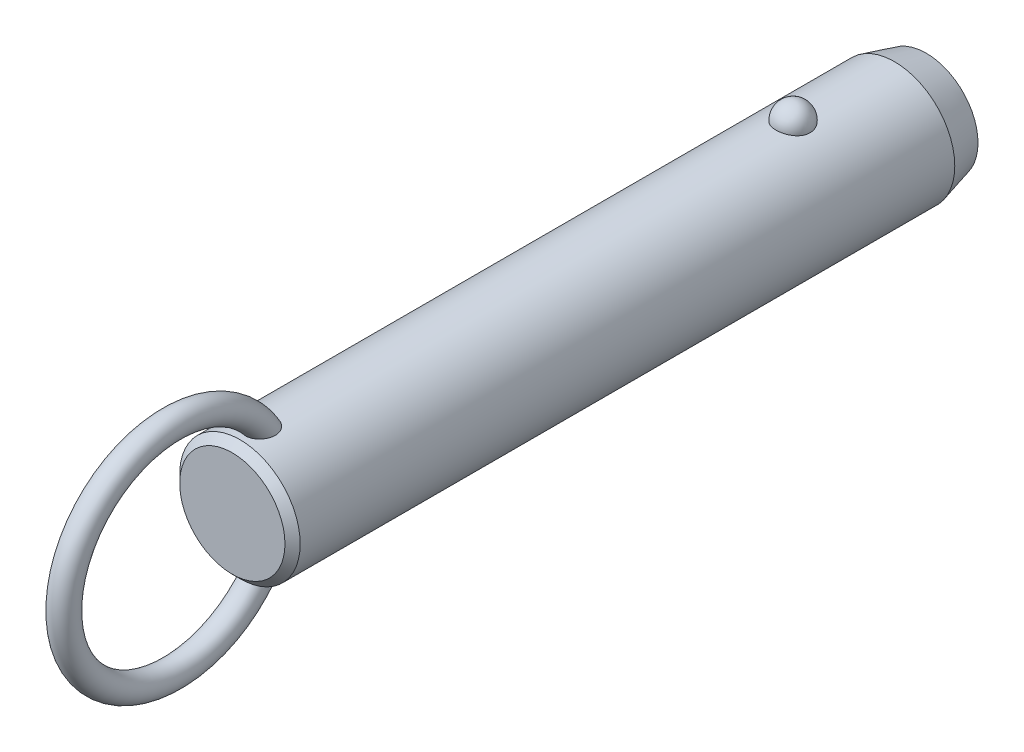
ISO-10303-21;
HEADER;
FILE_DESCRIPTION(('STEP AP214'),'2;1');
FILE_NAME('part.step','',(''),(''),'','','');
FILE_SCHEMA(('AUTOMOTIVE_DESIGN { 1 0 10303 214 1 1 1 1 }'));
ENDSEC;
DATA;
#1=APPLICATION_CONTEXT('core data for automotive mechanical design processes');
#2=APPLICATION_PROTOCOL_DEFINITION('international standard','automotive_design',2000,#1);
#3=PRODUCT_CONTEXT('',#1,'mechanical');
#4=PRODUCT('Part','Part','',(#3));
#5=PRODUCT_RELATED_PRODUCT_CATEGORY('part','',(#4));
#6=PRODUCT_DEFINITION_FORMATION('','',#4);
#7=PRODUCT_DEFINITION_CONTEXT('part definition',#1,'design');
#8=PRODUCT_DEFINITION('design','',#6,#7);
#9=PRODUCT_DEFINITION_SHAPE('','',#8);
#10=(LENGTH_UNIT() NAMED_UNIT(*) SI_UNIT(.MILLI.,.METRE.));
#11=(NAMED_UNIT(*) PLANE_ANGLE_UNIT() SI_UNIT($,.RADIAN.));
#12=(NAMED_UNIT(*) SI_UNIT($,.STERADIAN.) SOLID_ANGLE_UNIT());
#13=UNCERTAINTY_MEASURE_WITH_UNIT(LENGTH_MEASURE(1.E-05),#10,'distance_accuracy_value','');
#14=(GEOMETRIC_REPRESENTATION_CONTEXT(3) GLOBAL_UNCERTAINTY_ASSIGNED_CONTEXT((#13)) GLOBAL_UNIT_ASSIGNED_CONTEXT((#10,
#11,#12)) REPRESENTATION_CONTEXT('',''));
#15=CARTESIAN_POINT('',(0.,0.,0.));
#16=DIRECTION('',(0.,0.,1.));
#17=DIRECTION('',(1.,0.,0.));
#18=AXIS2_PLACEMENT_3D('',#15,#16,#17);
#19=CARTESIAN_POINT('',(0.,0.,76.2));
#20=DIRECTION('',(0.,0.,-1.));
#21=DIRECTION('',(-1.,0.,0.));
#22=AXIS2_PLACEMENT_3D('',#19,#20,#21);
#23=CYLINDRICAL_SURFACE('',#22,9.5);
#24=CARTESIAN_POINT('',(2.67259918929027,9.11631578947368,-2.70000000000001));
#25=CARTESIAN_POINT('',(2.6725968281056,9.11631786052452,-2.54909854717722));
#26=CARTESIAN_POINT('',(2.66030567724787,9.11994722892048,-2.39816735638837));
#27=CARTESIAN_POINT('',(2.6114347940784,9.13405924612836,-2.10058568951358));
#28=CARTESIAN_POINT('',(2.57484658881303,9.14454428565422,-1.95393672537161));
#29=CARTESIAN_POINT('',(2.47830875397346,9.17117631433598,-1.66916069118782));
#30=CARTESIAN_POINT('',(2.41836936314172,9.18732082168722,-1.53102991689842));
#31=CARTESIAN_POINT('',(2.27661331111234,9.22346780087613,-1.26705393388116));
#32=CARTESIAN_POINT('',(2.19479699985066,9.24347021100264,-1.14120852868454));
#33=CARTESIAN_POINT('',(2.01085282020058,9.28522401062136,-0.904632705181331));
#34=CARTESIAN_POINT('',(1.90862396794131,9.30698376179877,-0.793982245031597));
#35=CARTESIAN_POINT('',(1.6867437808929,9.34973971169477,-0.591607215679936));
#36=CARTESIAN_POINT('',(1.56709244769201,9.37073591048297,-0.499882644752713));
#37=CARTESIAN_POINT('',(1.31393976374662,9.40956370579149,-0.338167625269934));
#38=CARTESIAN_POINT('',(1.18048026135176,9.42740444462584,-0.268113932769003));
#39=CARTESIAN_POINT('',(0.903154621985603,9.45799906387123,-0.151390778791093));
#40=CARTESIAN_POINT('',(0.759289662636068,9.47075351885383,-0.10471867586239));
#41=CARTESIAN_POINT('',(0.46807402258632,9.48956256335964,-0.0367633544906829));
#42=CARTESIAN_POINT('',(0.320836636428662,9.49573643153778,-0.0150275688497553));
#43=CARTESIAN_POINT('',(0.02467145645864,9.50112183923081,0.00396199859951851));
#44=CARTESIAN_POINT('',(-0.124256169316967,9.50033406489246,0.00121819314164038));
#45=CARTESIAN_POINT('',(-0.417264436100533,9.4919475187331,-0.0284441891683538));
#46=CARTESIAN_POINT('',(-0.561384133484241,9.48444885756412,-0.055007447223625));
#47=CARTESIAN_POINT('',(-0.842986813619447,9.46357853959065,-0.131064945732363));
#48=CARTESIAN_POINT('',(-0.98046968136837,9.450206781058,-0.180559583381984));
#49=CARTESIAN_POINT('',(-1.24585005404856,9.41890822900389,-0.301476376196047));
#50=CARTESIAN_POINT('',(-1.37368611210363,9.40095498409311,-0.373026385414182));
#51=CARTESIAN_POINT('',(-1.61552738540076,9.36242964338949,-0.536025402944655));
#52=CARTESIAN_POINT('',(-1.72953116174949,9.34185727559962,-0.627476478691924));
#53=CARTESIAN_POINT('',(-1.9429225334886,9.29984568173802,-0.829844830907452));
#54=CARTESIAN_POINT('',(-2.04198021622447,9.27839736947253,-0.94110821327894));
#55=CARTESIAN_POINT('',(-2.2202646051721,9.23735994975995,-1.17883414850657));
#56=CARTESIAN_POINT('',(-2.29948985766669,9.21777097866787,-1.30529781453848));
#57=CARTESIAN_POINT('',(-2.43697287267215,9.18238994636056,-1.57158566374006));
#58=CARTESIAN_POINT('',(-2.49497068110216,9.16664569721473,-1.71155057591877));
#59=CARTESIAN_POINT('',(-2.5872073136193,9.14104303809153,-1.99961197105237));
#60=CARTESIAN_POINT('',(-2.62144683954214,9.13118445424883,-2.14770821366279));
#61=CARTESIAN_POINT('',(-2.66521466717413,9.11850622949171,-2.44715424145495));
#62=CARTESIAN_POINT('',(-2.67484831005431,9.11565658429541,-2.59848735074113));
#63=CARTESIAN_POINT('',(-2.66946735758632,9.11723375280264,-2.90067317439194));
#64=CARTESIAN_POINT('',(-2.65445345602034,9.12166036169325,-3.05152590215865));
#65=CARTESIAN_POINT('',(-2.60029711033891,9.13724422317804,-3.34766110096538));
#66=CARTESIAN_POINT('',(-2.56127978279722,9.14836656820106,-3.49296833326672));
#67=CARTESIAN_POINT('',(-2.46018844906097,9.17606676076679,-3.77477535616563));
#68=CARTESIAN_POINT('',(-2.39811349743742,9.1926448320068,-3.9112747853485));
#69=CARTESIAN_POINT('',(-2.25202303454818,9.22952198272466,-4.17244273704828));
#70=CARTESIAN_POINT('',(-2.16788714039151,9.24984129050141,-4.29704106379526));
#71=CARTESIAN_POINT('',(-1.9799408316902,9.29188255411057,-4.53013066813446));
#72=CARTESIAN_POINT('',(-1.87612963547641,9.31360456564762,-4.63862130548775));
#73=CARTESIAN_POINT('',(-1.65105429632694,9.35612959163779,-4.8369029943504));
#74=CARTESIAN_POINT('',(-1.52972405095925,9.37692871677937,-4.92661991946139));
#75=CARTESIAN_POINT('',(-1.27318250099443,9.41518970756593,-5.08429106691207));
#76=CARTESIAN_POINT('',(-1.13797219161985,9.432651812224,-5.15224684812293));
#77=CARTESIAN_POINT('',(-0.859280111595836,9.46208255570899,-5.26371827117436));
#78=CARTESIAN_POINT('',(-0.715925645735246,9.47411833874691,-5.30753421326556));
#79=CARTESIAN_POINT('',(-0.423550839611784,9.4916822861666,-5.37076321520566));
#80=CARTESIAN_POINT('',(-0.274531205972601,9.49721125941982,-5.39017930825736));
#81=CARTESIAN_POINT('',(0.021844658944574,9.50110860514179,-5.40390587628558));
#82=CARTESIAN_POINT('',(0.169177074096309,9.49961381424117,-5.39869609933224));
#83=CARTESIAN_POINT('',(0.460808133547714,9.48993906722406,-5.36441955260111));
#84=CARTESIAN_POINT('',(0.605106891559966,9.48175936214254,-5.33535367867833));
#85=CARTESIAN_POINT('',(0.886027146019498,9.4596376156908,-5.25435587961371));
#86=CARTESIAN_POINT('',(1.02267710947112,9.44571881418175,-5.20251612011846));
#87=CARTESIAN_POINT('',(1.28523827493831,9.41358993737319,-5.07741549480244));
#88=CARTESIAN_POINT('',(1.41114877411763,9.39537958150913,-5.00415322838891));
#89=CARTESIAN_POINT('',(1.65085227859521,9.3562644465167,-4.83684599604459));
#90=CARTESIAN_POINT('',(1.76442346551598,9.33532178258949,-4.74249218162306));
#91=CARTESIAN_POINT('',(1.97425672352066,9.29321198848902,-4.53620389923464));
#92=CARTESIAN_POINT('',(2.07051582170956,9.27204482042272,-4.42426641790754));
#93=CARTESIAN_POINT('',(2.24490086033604,9.23139221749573,-4.18363183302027));
#94=CARTESIAN_POINT('',(2.32267019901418,9.21194380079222,-4.05466990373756));
#95=CARTESIAN_POINT('',(2.45584092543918,9.1773419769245,-3.78517836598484));
#96=CARTESIAN_POINT('',(2.5112497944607,9.16218713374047,-3.64465264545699));
#97=CARTESIAN_POINT('',(2.59380876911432,9.13913522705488,-3.37104301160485));
#98=CARTESIAN_POINT('',(2.62330266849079,9.13064624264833,-3.23871053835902));
#99=CARTESIAN_POINT('',(2.66269870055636,9.11923566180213,-2.97092664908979));
#100=CARTESIAN_POINT('',(2.67260130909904,9.11631393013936,-2.83547530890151));
#101=CARTESIAN_POINT('',(2.67259918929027,9.11631578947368,-2.70000000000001));
#102=B_SPLINE_CURVE_WITH_KNOTS('',3,(#24,#25,#26,#27,#28,#29,#30,#31,#32,#33,#34,#35,#36,#37,
#38,#39,#40,#41,#42,#43,#44,#45,#46,#47,#48,#49,#50,#51,#52,#53,#54,#55,#56,#57,#58,#59,#60,#61,
#62,#63,#64,#65,#66,#67,#68,#69,#70,#71,#72,#73,#74,#75,#76,#77,#78,#79,#80,#81,#82,#83,#84,#85,
#86,#87,#88,#89,#90,#91,#92,#93,#94,#95,#96,#97,#98,#99,#100,#101),.UNSPECIFIED.,.T.,.F.,(4,2,2,
2,2,2,2,2,2,2,2,2,2,2,2,2,2,2,2,2,2,2,2,2,2,2,2,2,2,2,2,2,2,2,2,2,2,2,4),(0.,0.452217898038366,
0.904593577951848,1.35677112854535,1.80894144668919,2.26340676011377,2.71787203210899,
3.17099820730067,3.62407318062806,4.06878835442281,4.51345969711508,4.95160616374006,
5.38976021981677,5.83050358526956,6.27129275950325,6.72071308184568,7.17016633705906,
7.6249527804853,8.07972578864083,8.53254856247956,8.98535859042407,9.43582813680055,
9.88631615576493,10.3393155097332,10.7923328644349,11.2471065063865,11.7018475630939,
12.150795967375,12.599688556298,13.0398725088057,13.4800399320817,13.9184421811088,
14.3568730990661,14.802202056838,15.2476074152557,15.7010097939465,16.1542603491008,
16.5602594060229,16.966248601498),.UNSPECIFIED.);
#103=CARTESIAN_POINT('',(2.67259918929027,9.11631578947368,-2.70000000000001));
#104=VERTEX_POINT('',#103);
#105=EDGE_CURVE('E41',#104,#104,#102,.T.);
#106=ORIENTED_EDGE('',*,*,#105,.T.);
#107=EDGE_LOOP('',(#106));
#108=FACE_BOUND('',#107,.T.);
#109=CARTESIAN_POINT('',(0.,0.,84.5200000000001));
#110=DIRECTION('',(0.,0.,1.));
#111=DIRECTION('',(1.,0.,0.));
#112=AXIS2_PLACEMENT_3D('',#109,#110,#111);
#113=CIRCLE('',#112,9.5);
#114=CARTESIAN_POINT('',(9.5,0.,84.5200000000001));
#115=VERTEX_POINT('',#114);
#116=EDGE_CURVE('E10',#115,#115,#113,.F.);
#117=ORIENTED_EDGE('',*,*,#116,.T.);
#118=EDGE_LOOP('',(#117));
#119=FACE_BOUND('',#118,.T.);
#120=CARTESIAN_POINT('',(-0.697062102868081,-9.47439269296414,78.8678088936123));
#121=CARTESIAN_POINT('',(-0.799579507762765,-9.46685146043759,78.9074823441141));
#122=CARTESIAN_POINT('',(-0.898575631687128,-9.45788043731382,78.9559309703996));
#123=CARTESIAN_POINT('',(-1.08670047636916,-9.43811593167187,79.0688685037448));
#124=CARTESIAN_POINT('',(-1.17583204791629,-9.42732297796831,79.133352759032));
#125=CARTESIAN_POINT('',(-1.34179806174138,-9.40513672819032,79.2762099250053));
#126=CARTESIAN_POINT('',(-1.41865133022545,-9.39374438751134,79.354561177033));
#127=CARTESIAN_POINT('',(-1.5586004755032,-9.37154196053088,79.5227524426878));
#128=CARTESIAN_POINT('',(-1.62169476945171,-9.3607319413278,79.6125937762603));
#129=CARTESIAN_POINT('',(-1.73527695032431,-9.34035749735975,79.8045001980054));
#130=CARTESIAN_POINT('',(-1.7852226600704,-9.33085270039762,79.9068910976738));
#131=CARTESIAN_POINT('',(-1.86924997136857,-9.3143834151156,80.118148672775));
#132=CARTESIAN_POINT('',(-1.90332570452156,-9.30741986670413,80.2270177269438));
#133=CARTESIAN_POINT('',(-1.95893603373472,-9.29588482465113,80.4604730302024));
#134=CARTESIAN_POINT('',(-1.97872420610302,-9.29165182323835,80.5854890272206));
#135=CARTESIAN_POINT('',(-2.00062129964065,-9.28695978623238,80.8370805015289));
#136=CARTESIAN_POINT('',(-2.00272284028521,-9.28650232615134,80.963656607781));
#137=CARTESIAN_POINT('',(-1.98958876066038,-9.28932750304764,81.2368157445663));
#138=CARTESIAN_POINT('',(-1.97143366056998,-9.2932400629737,81.3832519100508));
#139=CARTESIAN_POINT('',(-1.91479925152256,-9.30507151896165,81.6720629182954));
#140=CARTESIAN_POINT('',(-1.87629122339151,-9.31299607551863,81.814431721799));
#141=CARTESIAN_POINT('',(-1.77225683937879,-9.33340232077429,82.1151725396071));
#142=CARTESIAN_POINT('',(-1.70334898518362,-9.34641636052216,82.2723691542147));
#143=CARTESIAN_POINT('',(-1.58111062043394,-9.36759153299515,82.4975171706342));
#144=CARTESIAN_POINT('',(-1.53721459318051,-9.37492619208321,82.5707968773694));
#145=CARTESIAN_POINT('',(-1.44302631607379,-9.38988566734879,82.7130740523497));
#146=CARTESIAN_POINT('',(-1.39273721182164,-9.39751033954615,82.7820736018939));
#147=CARTESIAN_POINT('',(-1.26775962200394,-9.41530678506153,82.9369832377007));
#148=CARTESIAN_POINT('',(-1.19052326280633,-9.42548108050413,83.0208712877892));
#149=CARTESIAN_POINT('',(-1.02420241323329,-9.44499825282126,83.1760086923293));
#150=CARTESIAN_POINT('',(-0.935139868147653,-9.45434261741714,83.2472808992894));
#151=CARTESIAN_POINT('',(-0.766610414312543,-9.46930670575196,83.3586955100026));
#152=CARTESIAN_POINT('',(-0.689439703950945,-9.47529223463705,83.4022354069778));
#153=CARTESIAN_POINT('',(-0.528942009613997,-9.48560294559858,83.4763133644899));
#154=CARTESIAN_POINT('',(-0.445620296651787,-9.48992953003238,83.5068624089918));
#155=CARTESIAN_POINT('',(-0.273901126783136,-9.49644161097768,83.5525792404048));
#156=CARTESIAN_POINT('',(-0.185465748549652,-9.49860811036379,83.56761059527));
#157=CARTESIAN_POINT('',(-0.00734541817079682,-9.5004135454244,83.5801494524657));
#158=CARTESIAN_POINT('',(0.0823387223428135,-9.50005405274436,83.5776678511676));
#159=CARTESIAN_POINT('',(0.247679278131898,-9.49708301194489,83.5569959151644));
#160=CARTESIAN_POINT('',(0.323620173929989,-9.49477609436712,83.5409300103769));
#161=CARTESIAN_POINT('',(0.471981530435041,-9.48855917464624,83.4971726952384));
#162=CARTESIAN_POINT('',(0.544400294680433,-9.48464840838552,83.469475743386));
#163=CARTESIAN_POINT('',(0.708947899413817,-9.47398336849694,83.3928026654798));
#164=CARTESIAN_POINT('',(0.799149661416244,-9.46671310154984,83.3397745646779));
#165=CARTESIAN_POINT('',(0.969783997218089,-9.45076225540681,83.2199731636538));
#166=CARTESIAN_POINT('',(1.05019415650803,-9.44207854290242,83.1531692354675));
#167=CARTESIAN_POINT('',(1.23092343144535,-9.42051459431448,82.9807596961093));
#168=CARTESIAN_POINT('',(1.3265249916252,-9.40733378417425,82.8702619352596));
#169=CARTESIAN_POINT('',(1.4989312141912,-9.38140745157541,82.6355614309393));
#170=CARTESIAN_POINT('',(1.57571616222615,-9.36866239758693,82.5113445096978));
#171=CARTESIAN_POINT('',(1.71285426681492,-9.34457644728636,82.2493891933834));
#172=CARTESIAN_POINT('',(1.77266365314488,-9.33328726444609,82.1113623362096));
#173=CARTESIAN_POINT('',(1.87239208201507,-9.31379209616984,81.8280515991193));
#174=CARTESIAN_POINT('',(1.9123015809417,-9.3055875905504,81.682764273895));
#175=CARTESIAN_POINT('',(1.9760418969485,-9.29228394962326,81.3620281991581));
#176=CARTESIAN_POINT('',(1.99587438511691,-9.28797202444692,81.1857248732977));
#177=CARTESIAN_POINT('',(2.0029570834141,-9.28645519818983,80.8324146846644));
#178=CARTESIAN_POINT('',(1.99025930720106,-9.28923895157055,80.6554093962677));
#179=CARTESIAN_POINT('',(1.93735479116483,-9.30038134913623,80.3563381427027));
#180=CARTESIAN_POINT('',(1.90576827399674,-9.30697680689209,80.2326679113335));
#181=CARTESIAN_POINT('',(1.82287484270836,-9.32356855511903,79.992329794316));
#182=CARTESIAN_POINT('',(1.77158213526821,-9.33356239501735,79.8756569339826));
#183=CARTESIAN_POINT('',(1.64885744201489,-9.35602275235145,79.6527061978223));
#184=CARTESIAN_POINT('',(1.57730995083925,-9.36850332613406,79.5464927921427));
#185=CARTESIAN_POINT('',(1.41543264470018,-9.39431873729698,79.3495530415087));
#186=CARTESIAN_POINT('',(1.32510883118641,-9.40765330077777,79.2588217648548));
#187=CARTESIAN_POINT('',(1.13846223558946,-9.43195720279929,79.1050334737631));
#188=CARTESIAN_POINT('',(1.04369890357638,-9.44302894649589,79.0400947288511));
#189=CARTESIAN_POINT('',(0.843965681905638,-9.46296805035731,78.9280388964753));
#190=CARTESIAN_POINT('',(0.73900000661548,-9.4718363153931,78.8809144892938));
#191=CARTESIAN_POINT('',(0.52817529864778,-9.48586140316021,78.8081173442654));
#192=CARTESIAN_POINT('',(0.422686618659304,-9.49119633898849,78.7814024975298));
#193=CARTESIAN_POINT('',(0.208590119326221,-9.49831365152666,78.7460137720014));
#194=CARTESIAN_POINT('',(0.0999817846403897,-9.500095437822,78.7373428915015));
#195=CARTESIAN_POINT('',(-0.126104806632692,-9.49988861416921,78.7383501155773));
#196=CARTESIAN_POINT('',(-0.243578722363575,-9.49757821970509,78.7495942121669));
#197=CARTESIAN_POINT('',(-0.474390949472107,-9.48885165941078,78.793167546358));
#198=CARTESIAN_POINT('',(-0.587729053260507,-9.48243528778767,78.8254978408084));
#199=CARTESIAN_POINT('',(-0.697062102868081,-9.47439269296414,78.8678088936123));
#200=B_SPLINE_CURVE_WITH_KNOTS('',3,(#120,#121,#122,#123,#124,#125,#126,#127,#128,#129,#130,
#131,#132,#133,#134,#135,#136,#137,#138,#139,#140,#141,#142,#143,#144,#145,#146,#147,#148,#149,
#150,#151,#152,#153,#154,#155,#156,#157,#158,#159,#160,#161,#162,#163,#164,#165,#166,#167,#168,
#169,#170,#171,#172,#173,#174,#175,#176,#177,#178,#179,#180,#181,#182,#183,#184,#185,#186,#187,
#188,#189,#190,#191,#192,#193,#194,#195,#196,#197,#198,#199),.UNSPECIFIED.,.T.,.F.,(4,2,2,2,2,2,
2,2,2,2,2,2,2,2,2,2,2,2,2,2,2,2,2,2,2,2,2,2,2,2,2,2,2,2,2,2,2,2,2,4),(0.,0.330119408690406,
0.660143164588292,0.989655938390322,1.31920659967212,1.66074728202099,2.00241415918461,
2.38088696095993,2.75951768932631,3.20065679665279,3.6424200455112,4.15620996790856,
4.41314162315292,4.66994734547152,5.01228664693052,5.35399933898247,5.61943037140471,
5.88463652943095,6.15215502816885,6.41950709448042,6.65144391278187,6.88349136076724,
7.19641200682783,7.51003602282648,7.94779711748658,8.38601491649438,8.83699707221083,
9.28819530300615,9.81778662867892,10.3465317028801,10.7284172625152,11.110028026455,
11.4938603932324,11.8775702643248,12.2220189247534,12.5663259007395,12.8915939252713,
13.2169159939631,13.5689650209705,13.9210316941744),.UNSPECIFIED.);
#201=CARTESIAN_POINT('',(-0.697062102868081,-9.47439269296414,78.8678088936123));
#202=VERTEX_POINT('',#201);
#203=EDGE_CURVE('E59',#202,#202,#200,.T.);
#204=ORIENTED_EDGE('',*,*,#203,.T.);
#205=EDGE_LOOP('',(#204));
#206=FACE_BOUND('',#205,.T.);
#207=CARTESIAN_POINT('',(-0.697062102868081,9.47439269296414,78.8678088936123));
#208=CARTESIAN_POINT('',(-0.597792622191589,9.48169483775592,78.8293956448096));
#209=CARTESIAN_POINT('',(-0.495106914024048,9.48766580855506,78.7991682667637));
#210=CARTESIAN_POINT('',(-0.285876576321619,9.49627648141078,78.7560327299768));
#211=CARTESIAN_POINT('',(-0.179324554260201,9.49890941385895,78.7431597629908));
#212=CARTESIAN_POINT('',(0.0344157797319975,9.50053798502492,78.7351666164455));
#213=CARTESIAN_POINT('',(0.141603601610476,9.49953613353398,78.7400341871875));
#214=CARTESIAN_POINT('',(0.353563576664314,9.49401038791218,78.7673654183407));
#215=CARTESIAN_POINT('',(0.458336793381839,9.48948807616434,78.78982117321));
#216=CARTESIAN_POINT('',(0.66249373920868,9.4774236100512,78.8516719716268));
#217=CARTESIAN_POINT('',(0.761881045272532,9.46988348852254,78.8910556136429));
#218=CARTESIAN_POINT('',(0.952608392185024,9.45260382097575,78.9856342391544));
#219=CARTESIAN_POINT('',(1.04394806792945,9.44286417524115,79.0408299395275));
#220=CARTESIAN_POINT('',(1.21712767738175,9.4221176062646,79.1660662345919));
#221=CARTESIAN_POINT('',(1.29885671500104,9.41109835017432,79.2362579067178));
#222=CARTESIAN_POINT('',(1.44978975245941,9.38903310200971,79.388980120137));
#223=CARTESIAN_POINT('',(1.51899278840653,9.37798710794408,79.4715116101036));
#224=CARTESIAN_POINT('',(1.64602857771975,9.35654375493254,79.6497763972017));
#225=CARTESIAN_POINT('',(1.70333052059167,9.34618688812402,79.7458916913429));
#226=CARTESIAN_POINT('',(1.80259341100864,9.32755128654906,79.945897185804));
#227=CARTESIAN_POINT('',(1.84454942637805,9.31927322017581,80.0497898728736));
#228=CARTESIAN_POINT('',(1.91637039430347,9.30478365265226,80.272213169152));
#229=CARTESIAN_POINT('',(1.944805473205,9.29882552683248,80.3912192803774));
#230=CARTESIAN_POINT('',(1.98449865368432,9.29043398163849,80.6321436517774));
#231=CARTESIAN_POINT('',(1.99574908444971,9.28800213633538,80.7540631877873));
#232=CARTESIAN_POINT('',(2.00275141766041,9.28649645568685,81.0169324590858));
#233=CARTESIAN_POINT('',(1.99588238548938,9.28799035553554,81.1579529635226));
#234=CARTESIAN_POINT('',(1.96270559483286,9.29505517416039,81.4376217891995));
#235=CARTESIAN_POINT('',(1.93637872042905,9.30063010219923,81.576267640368));
#236=CARTESIAN_POINT('',(1.85949176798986,9.31633564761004,81.8725616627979));
#237=CARTESIAN_POINT('',(1.80549792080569,9.3270926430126,82.0292907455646));
#238=CARTESIAN_POINT('',(1.67376869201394,9.35163064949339,82.3322840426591));
#239=CARTESIAN_POINT('',(1.59603181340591,9.36541185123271,82.4785475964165));
#240=CARTESIAN_POINT('',(1.4360277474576,9.39110706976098,82.7258138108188));
#241=CARTESIAN_POINT('',(1.35831795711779,9.40278656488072,82.829791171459));
#242=CARTESIAN_POINT('',(1.18774483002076,9.42585025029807,83.0245347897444));
#243=CARTESIAN_POINT('',(1.09490932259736,9.43723493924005,83.1153247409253));
#244=CARTESIAN_POINT('',(0.921110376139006,9.45552616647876,83.2562033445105));
#245=CARTESIAN_POINT('',(0.843738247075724,9.46281058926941,83.3106563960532));
#246=CARTESIAN_POINT('',(0.681245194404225,9.47589120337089,83.4067117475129));
#247=CARTESIAN_POINT('',(0.596135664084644,9.48168953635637,83.4483325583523));
#248=CARTESIAN_POINT('',(0.433779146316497,9.49038144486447,83.5100899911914));
#249=CARTESIAN_POINT('',(0.357459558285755,9.49359170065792,83.5326013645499));
#250=CARTESIAN_POINT('',(0.20207411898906,9.49816761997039,83.5645745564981));
#251=CARTESIAN_POINT('',(0.123010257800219,9.49953459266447,83.5740456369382));
#252=CARTESIAN_POINT('',(-0.0357372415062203,9.50026497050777,83.5791143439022));
#253=CARTESIAN_POINT('',(-0.115421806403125,9.49962433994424,83.5746840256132));
#254=CARTESIAN_POINT('',(-0.272823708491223,9.49640854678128,83.5522962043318));
#255=CARTESIAN_POINT('',(-0.350540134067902,9.4938325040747,83.5343325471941));
#256=CARTESIAN_POINT('',(-0.500580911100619,9.4870946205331,83.4868028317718));
#257=CARTESIAN_POINT('',(-0.572979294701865,9.48296359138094,83.4574618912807));
#258=CARTESIAN_POINT('',(-0.712864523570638,9.47347609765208,83.3890087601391));
#259=CARTESIAN_POINT('',(-0.78034909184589,9.46811906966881,83.3498920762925));
#260=CARTESIAN_POINT('',(-0.946309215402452,9.45329720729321,83.239432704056));
#261=CARTESIAN_POINT('',(-1.04090230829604,9.44321512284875,83.1623297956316));
#262=CARTESIAN_POINT('',(-1.21661929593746,9.42219227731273,82.9940971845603));
#263=CARTESIAN_POINT('',(-1.29770519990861,9.41124921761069,82.9029292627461));
#264=CARTESIAN_POINT('',(-1.47319646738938,9.38563439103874,82.6761621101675));
#265=CARTESIAN_POINT('',(-1.5620887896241,9.37102009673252,82.5362895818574));
#266=CARTESIAN_POINT('',(-1.71623987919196,9.34401559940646,82.2439503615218));
#267=CARTESIAN_POINT('',(-1.78147866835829,9.33162728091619,82.091473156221));
#268=CARTESIAN_POINT('',(-1.88853837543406,9.31055541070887,81.7756470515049));
#269=CARTESIAN_POINT('',(-1.92998995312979,9.30193076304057,81.6121685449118));
#270=CARTESIAN_POINT('',(-1.98590726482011,9.29015757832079,81.2805268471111));
#271=CARTESIAN_POINT('',(-2.0004070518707,9.2870021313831,81.1123698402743));
#272=CARTESIAN_POINT('',(-1.99964701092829,9.28716218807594,80.8050806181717));
#273=CARTESIAN_POINT('',(-1.98908145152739,9.28945704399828,80.6659362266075));
#274=CARTESIAN_POINT('',(-1.94566294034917,9.29865169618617,80.3911539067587));
#275=CARTESIAN_POINT('',(-1.91282062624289,9.30554929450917,80.255514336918));
#276=CARTESIAN_POINT('',(-1.84582133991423,9.31898248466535,80.0578026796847));
#277=CARTESIAN_POINT('',(-1.82038084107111,9.32400364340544,79.992583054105));
#278=CARTESIAN_POINT('',(-1.76350511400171,9.33492884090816,79.8649033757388));
#279=CARTESIAN_POINT('',(-1.73207305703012,9.34083241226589,79.8024418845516));
#280=CARTESIAN_POINT('',(-1.66324243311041,9.353333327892,79.6809407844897));
#281=CARTESIAN_POINT('',(-1.625842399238,9.35993084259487,79.621902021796));
#282=CARTESIAN_POINT('',(-1.54527678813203,9.37356864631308,79.5079875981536));
#283=CARTESIAN_POINT('',(-1.50211241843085,9.38060884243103,79.4531110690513));
#284=CARTESIAN_POINT('',(-1.37681147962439,9.40004442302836,79.309961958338));
#285=CARTESIAN_POINT('',(-1.28916358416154,9.41261047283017,79.2264295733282));
#286=CARTESIAN_POINT('',(-1.09996826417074,9.43658180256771,79.0772360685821));
#287=CARTESIAN_POINT('',(-0.99846185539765,9.44799034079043,79.0115238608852));
#288=CARTESIAN_POINT('',(-0.860188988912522,9.46103017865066,78.9394367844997));
#289=CARTESIAN_POINT('',(-0.828141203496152,9.46389141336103,78.9238511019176));
#290=CARTESIAN_POINT('',(-0.763210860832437,9.46934915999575,78.8944734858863));
#291=CARTESIAN_POINT('',(-0.730328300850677,9.47194567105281,78.8806815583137));
#292=CARTESIAN_POINT('',(-0.697062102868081,9.47439269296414,78.8678088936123));
#293=B_SPLINE_CURVE_WITH_KNOTS('',3,(#207,#208,#209,#210,#211,#212,#213,#214,#215,#216,#217,
#218,#219,#220,#221,#222,#223,#224,#225,#226,#227,#228,#229,#230,#231,#232,#233,#234,#235,#236,
#237,#238,#239,#240,#241,#242,#243,#244,#245,#246,#247,#248,#249,#250,#251,#252,#253,#254,#255,
#256,#257,#258,#259,#260,#261,#262,#263,#264,#265,#266,#267,#268,#269,#270,#271,#272,#273,#274,
#275,#276,#277,#278,#279,#280,#281,#282,#283,#284,#285,#286,#287,#288,#289,#290,#291,#292),
.UNSPECIFIED.,.T.,.F.,(4,2,2,2,2,2,2,2,2,2,2,2,2,2,2,2,2,2,2,2,2,2,2,2,2,2,2,2,2,2,2,2,2,2,2,2,
2,2,2,2,2,2,4),(0.,0.319942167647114,0.640532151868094,0.960900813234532,1.28112555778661,
1.60113495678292,1.92115886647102,2.24457323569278,2.56801248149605,2.90371927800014,
3.23953387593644,3.60560313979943,3.97183576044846,4.393836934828,4.81625324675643,
5.31257045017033,5.80891895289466,6.19868344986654,6.58773876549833,6.87145417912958,
7.15475838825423,7.3926375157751,7.63034760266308,7.86853584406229,8.10683246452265,
8.3406366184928,8.57454843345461,8.93983939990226,9.30614105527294,9.80266668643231,
10.2996107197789,10.8040753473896,11.3079021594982,11.7249776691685,12.1418541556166,
12.3521485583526,12.5623319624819,12.7725671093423,12.9827582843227,13.3458276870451,
13.7078449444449,13.8150604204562,13.9222762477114),.UNSPECIFIED.);
#294=CARTESIAN_POINT('',(-0.697062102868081,9.47439269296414,78.8678088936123));
#295=VERTEX_POINT('',#294);
#296=EDGE_CURVE('E67',#295,#295,#293,.T.);
#297=ORIENTED_EDGE('',*,*,#296,.T.);
#298=EDGE_LOOP('',(#297));
#299=FACE_BOUND('',#298,.T.);
#300=CARTESIAN_POINT('',(0.,0.,-18.7000000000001));
#301=DIRECTION('',(0.,0.,-1.));
#302=DIRECTION('',(-1.,0.,0.));
#303=AXIS2_PLACEMENT_3D('',#300,#301,#302);
#304=CIRCLE('',#303,9.5);
#305=CARTESIAN_POINT('',(9.5,0.,-18.7000000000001));
#306=VERTEX_POINT('',#305);
#307=EDGE_CURVE('E56',#306,#306,#304,.F.);
#308=ORIENTED_EDGE('',*,*,#307,.T.);
#309=EDGE_LOOP('',(#308));
#310=FACE_BOUND('',#309,.T.);
#311=ADVANCED_FACE('F37',(#108,#119,#206,#299,#310),#23,.T.);
#312=CARTESIAN_POINT('',(0.,0.,-23.7));
#313=DIRECTION('',(0.,0.,-1.));
#314=DIRECTION('',(-1.,0.,0.));
#315=AXIS2_PLACEMENT_3D('',#312,#313,#314);
#316=PLANE('',#315);
#317=CARTESIAN_POINT('',(0.,0.,-23.7));
#318=DIRECTION('',(0.,0.,-1.));
#319=DIRECTION('',(-1.,0.,0.));
#320=AXIS2_PLACEMENT_3D('',#317,#318,#319);
#321=CIRCLE('',#320,8.16025403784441);
#322=CARTESIAN_POINT('',(8.16025403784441,0.,-23.7));
#323=VERTEX_POINT('',#322);
#324=EDGE_CURVE('E66',#323,#323,#321,.T.);
#325=ORIENTED_EDGE('',*,*,#324,.T.);
#326=EDGE_LOOP('',(#325));
#327=FACE_BOUND('',#326,.T.);
#328=ADVANCED_FACE('F85',(#327),#316,.T.);
#329=CARTESIAN_POINT('',(0.,0.,-23.7));
#330=DIRECTION('',(0.,0.,1.));
#331=DIRECTION('',(1.,0.,0.));
#332=AXIS2_PLACEMENT_3D('',#329,#330,#331);
#333=CONICAL_SURFACE('',#332,8.16025403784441,0.261799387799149);
#334=CARTESIAN_POINT('',(9.5,0.,-18.7000000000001));
#335=CARTESIAN_POINT('',(9.48604431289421,0.,-18.7520833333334));
#336=CARTESIAN_POINT('',(9.47208862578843,0.,-18.8041666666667));
#337=CARTESIAN_POINT('',(9.44417725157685,0.,-18.9083333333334));
#338=CARTESIAN_POINT('',(9.43022156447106,0.,-18.9604166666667));
#339=CARTESIAN_POINT('',(9.40231019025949,0.,-19.0645833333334));
#340=CARTESIAN_POINT('',(9.3883545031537,0.,-19.1166666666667));
#341=CARTESIAN_POINT('',(9.36044312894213,0.,-19.2208333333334));
#342=CARTESIAN_POINT('',(9.34648744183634,0.,-19.2729166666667));
#343=CARTESIAN_POINT('',(9.31857606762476,0.,-19.3770833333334));
#344=CARTESIAN_POINT('',(9.30462038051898,0.,-19.4291666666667));
#345=CARTESIAN_POINT('',(9.2767090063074,0.,-19.5333333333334));
#346=CARTESIAN_POINT('',(9.26275331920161,0.,-19.5854166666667));
#347=CARTESIAN_POINT('',(9.23484194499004,0.,-19.6895833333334));
#348=CARTESIAN_POINT('',(9.22088625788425,0.,-19.7416666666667));
#349=CARTESIAN_POINT('',(9.19297488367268,0.,-19.8458333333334));
#350=CARTESIAN_POINT('',(9.17901919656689,0.,-19.8979166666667));
#351=CARTESIAN_POINT('',(9.15110782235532,0.,-20.0020833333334));
#352=CARTESIAN_POINT('',(9.13715213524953,0.,-20.0541666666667));
#353=CARTESIAN_POINT('',(9.10924076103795,0.,-20.1583333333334));
#354=CARTESIAN_POINT('',(9.09528507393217,0.,-20.2104166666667));
#355=CARTESIAN_POINT('',(9.06737369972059,0.,-20.3145833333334));
#356=CARTESIAN_POINT('',(9.0534180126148,0.,-20.3666666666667));
#357=CARTESIAN_POINT('',(9.02550663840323,0.,-20.4708333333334));
#358=CARTESIAN_POINT('',(9.01155095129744,0.,-20.5229166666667));
#359=CARTESIAN_POINT('',(8.98363957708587,0.,-20.6270833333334));
#360=CARTESIAN_POINT('',(8.96968388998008,0.,-20.6791666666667));
#361=CARTESIAN_POINT('',(8.94177251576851,0.,-20.7833333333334));
#362=CARTESIAN_POINT('',(8.92781682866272,0.,-20.8354166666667));
#363=CARTESIAN_POINT('',(8.89990545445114,0.,-20.9395833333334));
#364=CARTESIAN_POINT('',(8.88594976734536,0.,-20.9916666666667));
#365=CARTESIAN_POINT('',(8.85803839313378,0.,-21.0958333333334));
#366=CARTESIAN_POINT('',(8.84408270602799,0.,-21.1479166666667));
#367=CARTESIAN_POINT('',(8.81617133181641,0.,-21.2520833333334));
#368=CARTESIAN_POINT('',(8.80221564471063,0.,-21.3041666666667));
#369=CARTESIAN_POINT('',(8.77430427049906,0.,-21.4083333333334));
#370=CARTESIAN_POINT('',(8.76034858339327,0.,-21.4604166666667));
#371=CARTESIAN_POINT('',(8.73243720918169,0.,-21.5645833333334));
#372=CARTESIAN_POINT('',(8.7184815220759,0.,-21.6166666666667));
#373=CARTESIAN_POINT('',(8.69057014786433,0.,-21.7208333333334));
#374=CARTESIAN_POINT('',(8.67661446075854,0.,-21.7729166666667));
#375=CARTESIAN_POINT('',(8.64870308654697,0.,-21.8770833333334));
#376=CARTESIAN_POINT('',(8.63474739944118,0.,-21.9291666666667));
#377=CARTESIAN_POINT('',(8.6068360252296,0.,-22.0333333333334));
#378=CARTESIAN_POINT('',(8.59288033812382,0.,-22.0854166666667));
#379=CARTESIAN_POINT('',(8.56496896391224,0.,-22.1895833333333));
#380=CARTESIAN_POINT('',(8.55101327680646,0.,-22.2416666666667));
#381=CARTESIAN_POINT('',(8.52310190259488,0.,-22.3458333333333));
#382=CARTESIAN_POINT('',(8.50914621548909,0.,-22.3979166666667));
#383=CARTESIAN_POINT('',(8.48123484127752,0.,-22.5020833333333));
#384=CARTESIAN_POINT('',(8.46727915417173,0.,-22.5541666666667));
#385=CARTESIAN_POINT('',(8.43936777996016,0.,-22.6583333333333));
#386=CARTESIAN_POINT('',(8.42541209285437,0.,-22.7104166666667));
#387=CARTESIAN_POINT('',(8.39750071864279,0.,-22.8145833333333));
#388=CARTESIAN_POINT('',(8.38354503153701,0.,-22.8666666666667));
#389=CARTESIAN_POINT('',(8.35563365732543,0.,-22.9708333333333));
#390=CARTESIAN_POINT('',(8.34167797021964,0.,-23.0229166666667));
#391=CARTESIAN_POINT('',(8.31376659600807,0.,-23.1270833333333));
#392=CARTESIAN_POINT('',(8.29981090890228,0.,-23.1791666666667));
#393=CARTESIAN_POINT('',(8.27189953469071,0.,-23.2833333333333));
#394=CARTESIAN_POINT('',(8.25794384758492,0.,-23.3354166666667));
#395=CARTESIAN_POINT('',(8.23003247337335,0.,-23.4395833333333));
#396=CARTESIAN_POINT('',(8.21607678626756,0.,-23.4916666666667));
#397=CARTESIAN_POINT('',(8.18816541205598,0.,-23.5958333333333));
#398=CARTESIAN_POINT('',(8.1742097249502,0.,-23.6479166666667));
#399=CARTESIAN_POINT('',(8.16025403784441,0.,-23.7));
#400=B_SPLINE_CURVE_WITH_KNOTS('',3,(#334,#335,#336,#337,#338,#339,#340,#341,#342,#343,#344,
#345,#346,#347,#348,#349,#350,#351,#352,#353,#354,#355,#356,#357,#358,#359,#360,#361,#362,#363,
#364,#365,#366,#367,#368,#369,#370,#371,#372,#373,#374,#375,#376,#377,#378,#379,#380,#381,#382,
#383,#384,#385,#386,#387,#388,#389,#390,#391,#392,#393,#394,#395,#396,#397,#398,#399),
.UNSPECIFIED.,.F.,.F.,(4,2,2,2,2,2,2,2,2,2,2,2,2,2,2,2,2,2,2,2,2,2,2,2,2,2,2,2,2,2,2,2,4),(0.,
0.161761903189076,0.323523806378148,0.48528570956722,0.647047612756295,0.808809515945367,
0.970571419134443,1.13233332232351,1.29409522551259,1.45585712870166,1.61761903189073,
1.77938093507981,1.94114283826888,2.10290474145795,2.26466664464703,2.4264285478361,
2.58819045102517,2.74995235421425,2.91171425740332,3.07347616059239,3.23523806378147,
3.39699996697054,3.55876187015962,3.72052377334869,3.88228567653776,4.04404757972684,
4.20580948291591,4.36757138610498,4.52933328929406,4.69109519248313,4.8528570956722,
5.01461899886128,5.17638090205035),.UNSPECIFIED.);
#401=EDGE_CURVE('BSEAM83',#306,#323,#400,.T.);
#402=ORIENTED_EDGE('',*,*,#307,.F.);
#403=ORIENTED_EDGE('',*,*,#324,.F.);
#404=ORIENTED_EDGE('',*,*,#401,.T.);
#405=ORIENTED_EDGE('',*,*,#401,.F.);
#406=EDGE_LOOP('',(#402,#404,#403,#405));
#407=FACE_BOUND('',#406,.T.);
#408=ADVANCED_FACE('F83',(#407),#333,.T.);
#409=CARTESIAN_POINT('',(0.,0.,85.72));
#410=DIRECTION('',(0.,0.,1.));
#411=DIRECTION('',(1.,0.,0.));
#412=AXIS2_PLACEMENT_3D('',#409,#410,#411);
#413=PLANE('',#412);
#414=CARTESIAN_POINT('',(0.,0.,85.72));
#415=DIRECTION('',(0.,0.,1.));
#416=DIRECTION('',(1.,0.,0.));
#417=AXIS2_PLACEMENT_3D('',#414,#415,#416);
#418=CIRCLE('',#417,8.30000000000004);
#419=CARTESIAN_POINT('',(8.30000000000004,0.,85.72));
#420=VERTEX_POINT('',#419);
#421=EDGE_CURVE('E50',#420,#420,#418,.T.);
#422=ORIENTED_EDGE('',*,*,#421,.T.);
#423=EDGE_LOOP('',(#422));
#424=FACE_BOUND('',#423,.T.);
#425=ADVANCED_FACE('F77',(#424),#413,.T.);
#426=CARTESIAN_POINT('',(0.,0.,95.25));
#427=DIRECTION('',(1.,0.,0.));
#428=DIRECTION('',(0.,0.,-1.));
#429=AXIS2_PLACEMENT_3D('',#426,#427,#428);
#430=TOROIDAL_SURFACE('',#429,17.05,2.);
#431=ORIENTED_EDGE('',*,*,#296,.F.);
#432=EDGE_LOOP('',(#431));
#433=FACE_BOUND('',#432,.T.);
#434=ORIENTED_EDGE('',*,*,#203,.F.);
#435=EDGE_LOOP('',(#434));
#436=FACE_BOUND('',#435,.T.);
#437=ADVANCED_FACE('F73',(#433,#436),#430,.T.);
#438=CARTESIAN_POINT('',(0.,0.,85.72));
#439=DIRECTION('',(0.,0.,-1.));
#440=DIRECTION('',(-1.,0.,0.));
#441=AXIS2_PLACEMENT_3D('',#438,#439,#440);
#442=CONICAL_SURFACE('',#441,8.30000000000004,0.785398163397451);
#443=ORIENTED_EDGE('',*,*,#116,.F.);
#444=EDGE_LOOP('',(#443));
#445=FACE_BOUND('',#444,.T.);
#446=ORIENTED_EDGE('',*,*,#421,.F.);
#447=EDGE_LOOP('',(#446));
#448=FACE_BOUND('',#447,.T.);
#449=ADVANCED_FACE('F39',(#445,#448),#442,.T.);
#450=CARTESIAN_POINT('',(0.,9.5,-2.70000000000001));
#451=DIRECTION('',(0.,1.,0.));
#452=DIRECTION('',(0.,0.,-1.));
#453=AXIS2_PLACEMENT_3D('',#450,#451,#452);
#454=SPHERICAL_SURFACE('',#453,2.7);
#455=ORIENTED_EDGE('',*,*,#105,.F.);
#456=EDGE_LOOP('',(#455));
#457=FACE_BOUND('',#456,.T.);
#458=ADVANCED_FACE('F79',(#457),#454,.T.);
#459=CLOSED_SHELL('',(#311,#328,#408,#425,#437,#449,#458));
#460=MANIFOLD_SOLID_BREP('B2',#459);
#461=ADVANCED_BREP_SHAPE_REPRESENTATION('',(#18,#460),#14);
#462=SHAPE_DEFINITION_REPRESENTATION(#9,#461);
ENDSEC;
END-ISO-10303-21;
